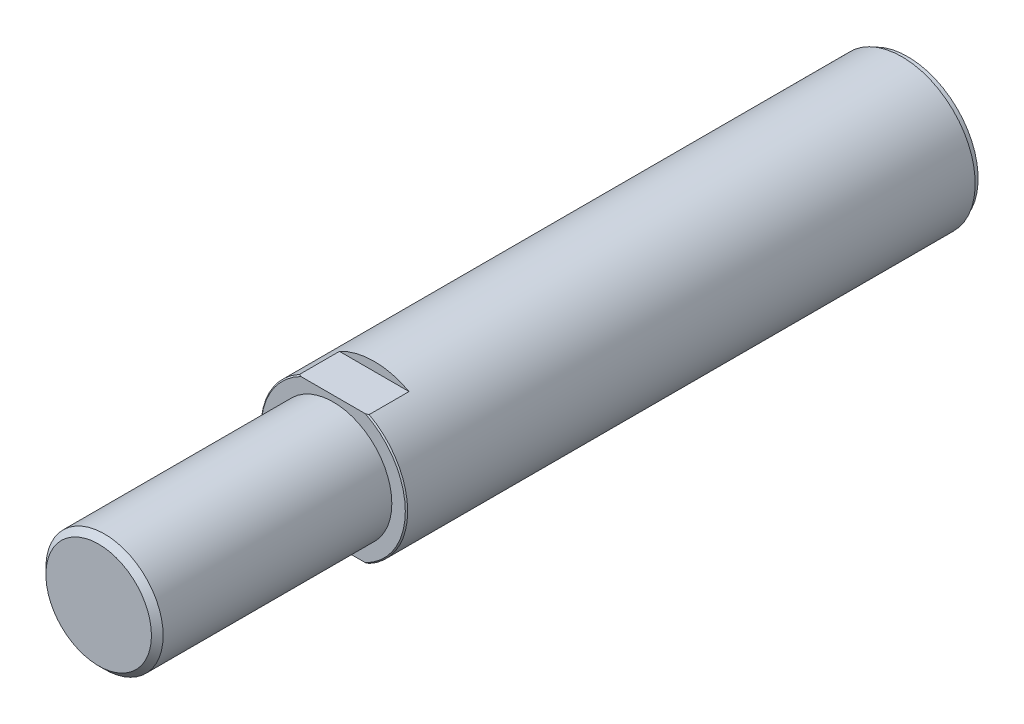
from build123d import *

# Parameters (mm, degrees)
ESBO_O1_R                       = 12.5
RESSALTO_EXTRUS_O1_DEPTH        = 138
ESBO_O2_OUTSIDE_W               = 55.492
ESBO_O2_OUTSIDE_H               = 55.492
ESBO_O2_OUTSIDE_R               = 10
CORTE_EXTRUS_O1_DEPTH           = 40
FURO_ROSCADO_DE_M12X1_751_D     = 10.2
FURO_ROSCADO_DE_M12X1_751_DEPTH = 32.75
FURO_ROSCADO_DE_M12X1_751_TIP   = 3.064389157
ESBO_O5_OUTSIDE_W               = 55.492
ESBO_O5_OUTSIDE_H               = 55.492
ESBO_O5_OUTSIDE_R               = 12
CORTE_EXTRUS_O2_DEPTH           = 1
CHANFRO1_SIZE                   = 0.2
CHANFRO2_SIZE                   = 1
ESBO_O6_OUTSIDE_W               = 55.492
ESBO_O6_OUTSIDE_H               = 55.492
ESBO_O6_OUTSIDE_W_2             = 42.182879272
ESBO_O6_OUTSIDE_H_2             = 22
CORTE_EXTRUS_O3_DEPTH           = 7


with BuildPart() as part:
    # Esbo_o1 → Ressalto-extrus_o1 (new body)
    with BuildSketch(Plane.XY):
        Circle(ESBO_O1_R)
    extrude(amount=RESSALTO_EXTRUS_O1_DEPTH)

    # Esbo_o2 outside → Corte-extrus_o1 (cut)
    with BuildSketch(Plane.XY.offset(138)):
        Rectangle(ESBO_O2_OUTSIDE_W, ESBO_O2_OUTSIDE_H)
        Circle(ESBO_O2_OUTSIDE_R, mode=Mode.SUBTRACT)
    extrude(amount=-CORTE_EXTRUS_O1_DEPTH, mode=Mode.SUBTRACT)

    # Furo roscado de M12x1.751
    with Locations(Plane(origin=(0, 0, 0), x_dir=(-1, 0, 0), z_dir=(0, 0, -1))):
        with Locations((0, 0)):
            Hole(FURO_ROSCADO_DE_M12X1_751_D / 2, depth=FURO_ROSCADO_DE_M12X1_751_DEPTH)
            with Locations((0, 0, -(FURO_ROSCADO_DE_M12X1_751_DEPTH + FURO_ROSCADO_DE_M12X1_751_TIP / 2))):  # 118° drill point
                Cone(0, FURO_ROSCADO_DE_M12X1_751_D / 2, FURO_ROSCADO_DE_M12X1_751_TIP, mode=Mode.SUBTRACT)

    # Esbo_o5 outside → Corte-extrus_o2 (cut)
    with BuildSketch(Plane(origin=(0, 0, 0), x_dir=(-1, 0, 0), z_dir=(0, 0, -1))):
        Rectangle(ESBO_O5_OUTSIDE_W, ESBO_O5_OUTSIDE_H)
        Circle(ESBO_O5_OUTSIDE_R, mode=Mode.SUBTRACT)
    extrude(amount=-CORTE_EXTRUS_O2_DEPTH, mode=Mode.SUBTRACT)

    # Chanfro1
    chanfro1_edges = [part.edges().sort_by_distance(p)[0] for p in [
        (-12.5, 0, 98),
    ]]
    chamfer(chanfro1_edges, length=CHANFRO1_SIZE)

    # Chanfro2
    chanfro2_edges = [part.edges().sort_by_distance(p)[0] for p in [
        (-10, 0, 138),
    ]]
    chamfer(chanfro2_edges, length=CHANFRO2_SIZE)

    # Esbo_o6 outside → Corte-extrus_o3 (cut)
    with BuildSketch(Plane.XY.offset(98)):
        Rectangle(ESBO_O6_OUTSIDE_W, ESBO_O6_OUTSIDE_H)
        Rectangle(ESBO_O6_OUTSIDE_W_2, ESBO_O6_OUTSIDE_H_2, mode=Mode.SUBTRACT)
    extrude(amount=-CORTE_EXTRUS_O3_DEPTH, mode=Mode.SUBTRACT)


solid = part.part
